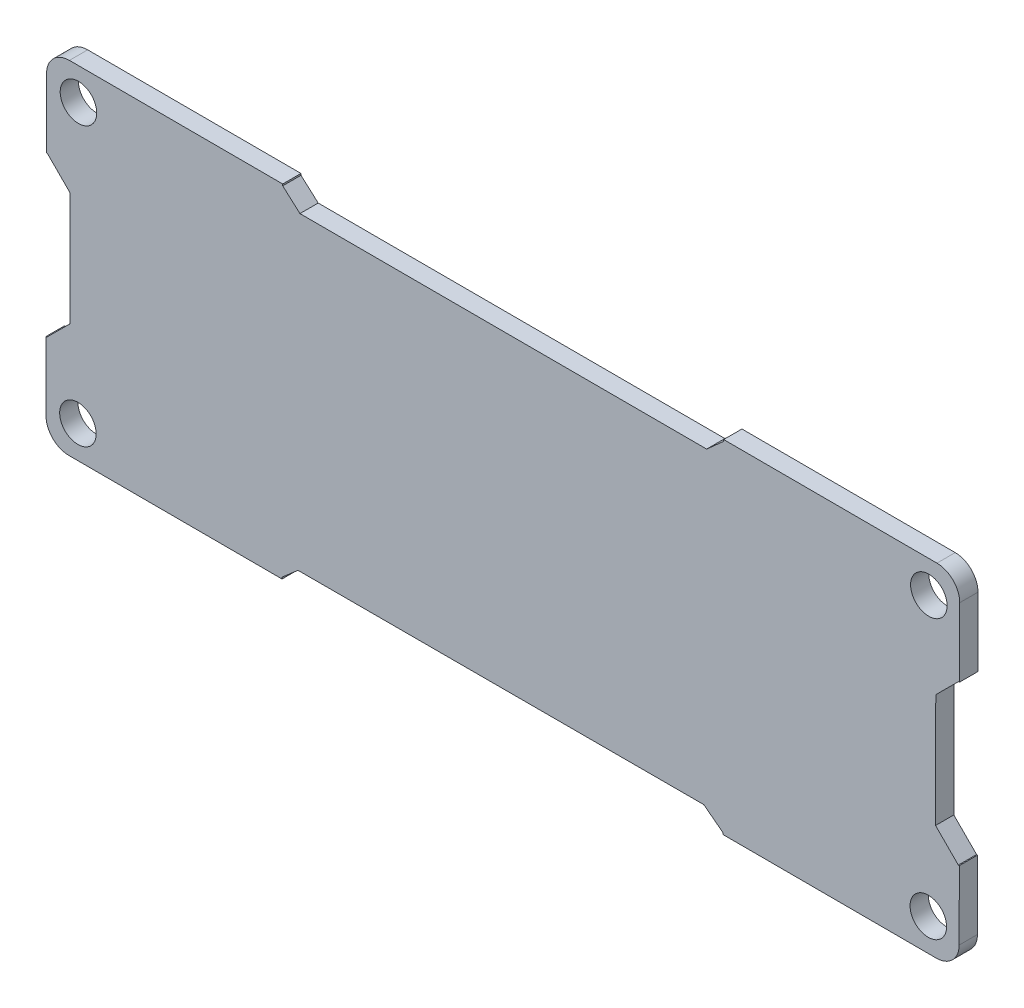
from build123d import *

# Parameters (mm, degrees)
CROQUIS1_R              = 1.6
SALIENTE_EXTRUIR1_DEPTH = 1.6


with BuildPart() as part:
    # Croquis1 → Saliente-Extruir1 (new body)
    with BuildSketch(Plane.XY):
        with BuildLine():
            Line((-0.677641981, 17.138643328), (-2.673862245, 19.142415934))
            Line((-2.673862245, 19.142415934), (-2.758862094, 19.142576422))
            Line((-2.758862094, 19.142576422), (-2.747471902, 25.175232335))
            ThreePointArc((-2.747471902, 25.175232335), (-2.159016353, 26.588337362), (-0.743699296, 27.171452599))
            Line((-0.743699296, 27.171452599), (17.941600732, 27.13617309))
            Line((17.941600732, 27.13617309), (17.941333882, 26.994840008))
            Line((17.941333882, 26.994840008), (19.450387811, 25.644921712))
            Line((19.450387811, 25.644921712), (55.079018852, 25.592418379))
            Line((55.079018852, 25.592418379), (56.570598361, 26.921904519))
            Line((56.570598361, 26.921904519), (56.570865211, 27.0632376))
            Line((56.570865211, 27.0632376), (75.256165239, 27.02795809))
            ThreePointArc((75.256165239, 27.02795809), (76.669270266, 26.439502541), (77.252385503, 25.024185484))
            Line((77.252385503, 25.024185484), (77.240995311, 18.99152957))
            Line((77.240995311, 18.99152957), (77.155995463, 18.991690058))
            Line((77.155995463, 18.991690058), (75.152222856, 16.995469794))
            Line((75.152222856, 16.995469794), (75.133465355, 7.060820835))
            Line((75.133465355, 7.060820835), (77.129685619, 5.057048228))
            Line((77.129685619, 5.057048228), (77.214685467, 5.056887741))
            Line((77.214685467, 5.056887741), (77.203295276, -0.975768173))
            ThreePointArc((77.203295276, -0.975768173), (76.614839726, -2.388873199), (75.19952267, -2.971988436))
            Line((75.19952267, -2.971988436), (56.514222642, -2.936708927))
            Line((56.514222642, -2.936708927), (56.514489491, -2.795375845))
            Line((56.514489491, -2.795375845), (54.831652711, -1.506829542))
            Line((54.831652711, -1.506829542), (19.275356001, -1.506829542))
            Line((19.275356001, -1.506829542), (17.885225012, -2.722440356))
            Line((17.885225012, -2.722440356), (17.884958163, -2.863773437))
            Line((17.884958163, -2.863773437), (-0.800341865, -2.828493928))
            ThreePointArc((-0.800341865, -2.828493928), (-2.213446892, -2.240038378), (-2.796562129, -0.824721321))
            Line((-2.796562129, -0.824721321), (-2.785171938, 5.207934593))
            Line((-2.785171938, 5.207934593), (-2.700172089, 5.207774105))
            Line((-2.700172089, 5.207774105), (-0.696399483, 7.203994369))
            Line((-0.696399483, 7.203994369), (-0.677641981, 17.138643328))
        make_face()
        with Locations((74.544893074, 24.236296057)):
            Circle(CROQUIS1_R, mode=Mode.SUBTRACT)
        Circle(CROQUIS1_R, mode=Mode.SUBTRACT)
        with Locations((0.046025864, 24.37695655)):
            Circle(CROQUIS1_R, mode=Mode.SUBTRACT)
        with Locations((74.49886721, -0.140660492)):
            Circle(CROQUIS1_R, mode=Mode.SUBTRACT)
    extrude(amount=SALIENTE_EXTRUIR1_DEPTH)


solid = part.part
